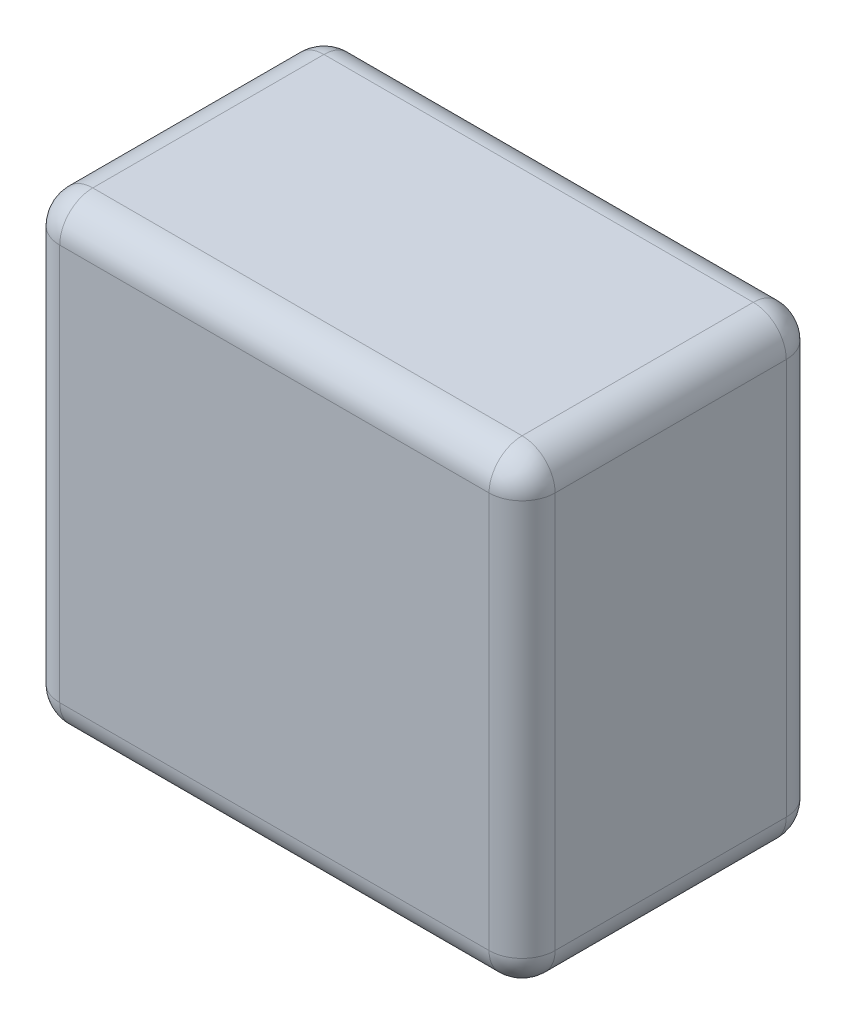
ISO-10303-21;
HEADER;
FILE_DESCRIPTION(('STEP AP214'),'2;1');
FILE_NAME('part.step','',(''),(''),'','','');
FILE_SCHEMA(('AUTOMOTIVE_DESIGN { 1 0 10303 214 1 1 1 1 }'));
ENDSEC;
DATA;
#1=APPLICATION_CONTEXT('core data for automotive mechanical design processes');
#2=APPLICATION_PROTOCOL_DEFINITION('international standard','automotive_design',2000,#1);
#3=PRODUCT_CONTEXT('',#1,'mechanical');
#4=PRODUCT('Part','Part','',(#3));
#5=PRODUCT_RELATED_PRODUCT_CATEGORY('part','',(#4));
#6=PRODUCT_DEFINITION_FORMATION('','',#4);
#7=PRODUCT_DEFINITION_CONTEXT('part definition',#1,'design');
#8=PRODUCT_DEFINITION('design','',#6,#7);
#9=PRODUCT_DEFINITION_SHAPE('','',#8);
#10=(LENGTH_UNIT() NAMED_UNIT(*) SI_UNIT(.MILLI.,.METRE.));
#11=(NAMED_UNIT(*) PLANE_ANGLE_UNIT() SI_UNIT($,.RADIAN.));
#12=(NAMED_UNIT(*) SI_UNIT($,.STERADIAN.) SOLID_ANGLE_UNIT());
#13=UNCERTAINTY_MEASURE_WITH_UNIT(LENGTH_MEASURE(1.E-05),#10,'distance_accuracy_value','');
#14=(GEOMETRIC_REPRESENTATION_CONTEXT(3) GLOBAL_UNCERTAINTY_ASSIGNED_CONTEXT((#13)) GLOBAL_UNIT_ASSIGNED_CONTEXT((#10,
#11,#12)) REPRESENTATION_CONTEXT('',''));
#15=CARTESIAN_POINT('',(0.,0.,0.));
#16=DIRECTION('',(0.,0.,1.));
#17=DIRECTION('',(1.,0.,0.));
#18=AXIS2_PLACEMENT_3D('',#15,#16,#17);
#19=CARTESIAN_POINT('',(0.,28.,0.));
#20=DIRECTION('',(1.,0.,0.));
#21=DIRECTION('',(0.,0.,-1.));
#22=AXIS2_PLACEMENT_3D('',#19,#20,#21);
#23=PLANE('',#22);
#24=DIRECTION('',(0.,0.,1.));
#25=VECTOR('',#24,1.);
#26=CARTESIAN_POINT('',(0.,26.,0.));
#27=LINE('',#26,#25);
#28=CARTESIAN_POINT('',(0.,26.,-2.));
#29=VERTEX_POINT('',#28);
#30=CARTESIAN_POINT('',(0.,26.,-16.));
#31=VERTEX_POINT('',#30);
#32=EDGE_CURVE('E138',#29,#31,#27,.F.);
#33=ORIENTED_EDGE('',*,*,#32,.T.);
#34=DIRECTION('',(0.,-1.,0.));
#35=VECTOR('',#34,1.);
#36=CARTESIAN_POINT('',(0.,28.,-16.));
#37=LINE('',#36,#35);
#38=CARTESIAN_POINT('',(0.,2.,-16.));
#39=VERTEX_POINT('',#38);
#40=EDGE_CURVE('E187',#31,#39,#37,.T.);
#41=ORIENTED_EDGE('',*,*,#40,.T.);
#42=DIRECTION('',(0.,0.,1.));
#43=VECTOR('',#42,1.);
#44=CARTESIAN_POINT('',(0.,2.,0.));
#45=LINE('',#44,#43);
#46=CARTESIAN_POINT('',(0.,2.,-2.));
#47=VERTEX_POINT('',#46);
#48=EDGE_CURVE('E184',#39,#47,#45,.T.);
#49=ORIENTED_EDGE('',*,*,#48,.T.);
#50=DIRECTION('',(0.,-1.,0.));
#51=VECTOR('',#50,1.);
#52=CARTESIAN_POINT('',(0.,28.,-2.));
#53=LINE('',#52,#51);
#54=EDGE_CURVE('E182',#47,#29,#53,.F.);
#55=ORIENTED_EDGE('',*,*,#54,.T.);
#56=EDGE_LOOP('',(#33,#41,#49,#55));
#57=FACE_BOUND('',#56,.T.);
#58=ADVANCED_FACE('F32',(#57),#23,.F.);
#59=CARTESIAN_POINT('',(0.,28.,0.));
#60=DIRECTION('',(0.,0.,-1.));
#61=DIRECTION('',(-1.,0.,0.));
#62=AXIS2_PLACEMENT_3D('',#59,#60,#61);
#63=PLANE('',#62);
#64=DIRECTION('',(1.,0.,0.));
#65=VECTOR('',#64,1.);
#66=CARTESIAN_POINT('',(0.,26.,0.));
#67=LINE('',#66,#65);
#68=CARTESIAN_POINT('',(28.,26.,0.));
#69=VERTEX_POINT('',#68);
#70=CARTESIAN_POINT('',(2.,26.,0.));
#71=VERTEX_POINT('',#70);
#72=EDGE_CURVE('E193',#69,#71,#67,.F.);
#73=ORIENTED_EDGE('',*,*,#72,.T.);
#74=DIRECTION('',(0.,-1.,0.));
#75=VECTOR('',#74,1.);
#76=CARTESIAN_POINT('',(2.,28.,0.));
#77=LINE('',#76,#75);
#78=CARTESIAN_POINT('',(2.,2.,0.));
#79=VERTEX_POINT('',#78);
#80=EDGE_CURVE('E196',#71,#79,#77,.T.);
#81=ORIENTED_EDGE('',*,*,#80,.T.);
#82=DIRECTION('',(1.,0.,0.));
#83=VECTOR('',#82,1.);
#84=CARTESIAN_POINT('',(30.,2.,0.));
#85=LINE('',#84,#83);
#86=CARTESIAN_POINT('',(28.,2.,0.));
#87=VERTEX_POINT('',#86);
#88=EDGE_CURVE('E191',#79,#87,#85,.T.);
#89=ORIENTED_EDGE('',*,*,#88,.T.);
#90=DIRECTION('',(0.,-1.,0.));
#91=VECTOR('',#90,1.);
#92=CARTESIAN_POINT('',(28.,28.,0.));
#93=LINE('',#92,#91);
#94=EDGE_CURVE('E189',#87,#69,#93,.F.);
#95=ORIENTED_EDGE('',*,*,#94,.T.);
#96=EDGE_LOOP('',(#73,#81,#89,#95));
#97=FACE_BOUND('',#96,.T.);
#98=ADVANCED_FACE('F299',(#97),#63,.F.);
#99=CARTESIAN_POINT('',(30.,28.,0.));
#100=DIRECTION('',(-1.,0.,0.));
#101=DIRECTION('',(0.,0.,1.));
#102=AXIS2_PLACEMENT_3D('',#99,#100,#101);
#103=PLANE('',#102);
#104=DIRECTION('',(0.,0.,-1.));
#105=VECTOR('',#104,1.);
#106=CARTESIAN_POINT('',(30.,2.,-18.));
#107=LINE('',#106,#105);
#108=CARTESIAN_POINT('',(30.,2.,-2.));
#109=VERTEX_POINT('',#108);
#110=CARTESIAN_POINT('',(30.,2.,-16.));
#111=VERTEX_POINT('',#110);
#112=EDGE_CURVE('E166',#109,#111,#107,.T.);
#113=ORIENTED_EDGE('',*,*,#112,.T.);
#114=DIRECTION('',(0.,-1.,0.));
#115=VECTOR('',#114,1.);
#116=CARTESIAN_POINT('',(30.,28.,-16.));
#117=LINE('',#116,#115);
#118=CARTESIAN_POINT('',(30.,26.,-16.));
#119=VERTEX_POINT('',#118);
#120=EDGE_CURVE('E171',#111,#119,#117,.F.);
#121=ORIENTED_EDGE('',*,*,#120,.T.);
#122=DIRECTION('',(0.,0.,-1.));
#123=VECTOR('',#122,1.);
#124=CARTESIAN_POINT('',(30.,26.,0.));
#125=LINE('',#124,#123);
#126=CARTESIAN_POINT('',(30.,26.,-2.));
#127=VERTEX_POINT('',#126);
#128=EDGE_CURVE('E168',#119,#127,#125,.F.);
#129=ORIENTED_EDGE('',*,*,#128,.T.);
#130=DIRECTION('',(0.,-1.,0.));
#131=VECTOR('',#130,1.);
#132=CARTESIAN_POINT('',(30.,28.,-2.));
#133=LINE('',#132,#131);
#134=EDGE_CURVE('E164',#127,#109,#133,.T.);
#135=ORIENTED_EDGE('',*,*,#134,.T.);
#136=EDGE_LOOP('',(#113,#121,#129,#135));
#137=FACE_BOUND('',#136,.T.);
#138=ADVANCED_FACE('F304',(#137),#103,.F.);
#139=CARTESIAN_POINT('',(0.,28.,-18.));
#140=DIRECTION('',(0.,0.,1.));
#141=DIRECTION('',(1.,0.,0.));
#142=AXIS2_PLACEMENT_3D('',#139,#140,#141);
#143=PLANE('',#142);
#144=DIRECTION('',(-1.,0.,0.));
#145=VECTOR('',#144,1.);
#146=CARTESIAN_POINT('',(0.,2.,-18.));
#147=LINE('',#146,#145);
#148=CARTESIAN_POINT('',(28.,2.,-18.));
#149=VERTEX_POINT('',#148);
#150=CARTESIAN_POINT('',(2.,2.,-18.));
#151=VERTEX_POINT('',#150);
#152=EDGE_CURVE('E175',#149,#151,#147,.T.);
#153=ORIENTED_EDGE('',*,*,#152,.T.);
#154=DIRECTION('',(0.,-1.,0.));
#155=VECTOR('',#154,1.);
#156=CARTESIAN_POINT('',(2.,28.,-18.));
#157=LINE('',#156,#155);
#158=CARTESIAN_POINT('',(2.,26.,-18.));
#159=VERTEX_POINT('',#158);
#160=EDGE_CURVE('E180',#151,#159,#157,.F.);
#161=ORIENTED_EDGE('',*,*,#160,.T.);
#162=DIRECTION('',(-1.,0.,0.));
#163=VECTOR('',#162,1.);
#164=CARTESIAN_POINT('',(0.,26.,-18.));
#165=LINE('',#164,#163);
#166=CARTESIAN_POINT('',(28.,26.,-18.));
#167=VERTEX_POINT('',#166);
#168=EDGE_CURVE('E177',#159,#167,#165,.F.);
#169=ORIENTED_EDGE('',*,*,#168,.T.);
#170=DIRECTION('',(0.,-1.,0.));
#171=VECTOR('',#170,1.);
#172=CARTESIAN_POINT('',(28.,28.,-18.));
#173=LINE('',#172,#171);
#174=EDGE_CURVE('E173',#167,#149,#173,.T.);
#175=ORIENTED_EDGE('',*,*,#174,.T.);
#176=EDGE_LOOP('',(#153,#161,#169,#175));
#177=FACE_BOUND('',#176,.T.);
#178=ADVANCED_FACE('F264',(#177),#143,.F.);
#179=CARTESIAN_POINT('',(0.,28.,0.));
#180=DIRECTION('',(0.,-1.,0.));
#181=DIRECTION('',(0.,0.,-1.));
#182=AXIS2_PLACEMENT_3D('',#179,#180,#181);
#183=PLANE('',#182);
#184=DIRECTION('',(1.,0.,0.));
#185=VECTOR('',#184,1.);
#186=CARTESIAN_POINT('',(0.,28.,-2.));
#187=LINE('',#186,#185);
#188=CARTESIAN_POINT('',(2.,28.,-2.));
#189=VERTEX_POINT('',#188);
#190=CARTESIAN_POINT('',(28.,28.,-2.));
#191=VERTEX_POINT('',#190);
#192=EDGE_CURVE('E124',#189,#191,#187,.T.);
#193=ORIENTED_EDGE('',*,*,#192,.T.);
#194=DIRECTION('',(0.,0.,-1.));
#195=VECTOR('',#194,1.);
#196=CARTESIAN_POINT('',(28.,28.,0.));
#197=LINE('',#196,#195);
#198=CARTESIAN_POINT('',(28.,28.,-16.));
#199=VERTEX_POINT('',#198);
#200=EDGE_CURVE('E162',#191,#199,#197,.T.);
#201=ORIENTED_EDGE('',*,*,#200,.T.);
#202=DIRECTION('',(-1.,0.,0.));
#203=VECTOR('',#202,1.);
#204=CARTESIAN_POINT('',(0.,28.,-16.));
#205=LINE('',#204,#203);
#206=CARTESIAN_POINT('',(2.,28.,-16.));
#207=VERTEX_POINT('',#206);
#208=EDGE_CURVE('E127',#199,#207,#205,.T.);
#209=ORIENTED_EDGE('',*,*,#208,.T.);
#210=DIRECTION('',(0.,0.,1.));
#211=VECTOR('',#210,1.);
#212=CARTESIAN_POINT('',(2.,28.,0.));
#213=LINE('',#212,#211);
#214=EDGE_CURVE('E119',#207,#189,#213,.T.);
#215=ORIENTED_EDGE('',*,*,#214,.T.);
#216=EDGE_LOOP('',(#193,#201,#209,#215));
#217=FACE_BOUND('',#216,.T.);
#218=ADVANCED_FACE('F121',(#217),#183,.F.);
#219=CARTESIAN_POINT('',(0.,0.,0.));
#220=DIRECTION('',(0.,-1.,0.));
#221=DIRECTION('',(0.,0.,-1.));
#222=AXIS2_PLACEMENT_3D('',#219,#220,#221);
#223=PLANE('',#222);
#224=DIRECTION('',(0.,0.,-1.));
#225=VECTOR('',#224,1.);
#226=CARTESIAN_POINT('',(28.,0.,0.));
#227=LINE('',#226,#225);
#228=CARTESIAN_POINT('',(28.,0.,-16.));
#229=VERTEX_POINT('',#228);
#230=CARTESIAN_POINT('',(28.,0.,-2.));
#231=VERTEX_POINT('',#230);
#232=EDGE_CURVE('E41',#229,#231,#227,.F.);
#233=ORIENTED_EDGE('',*,*,#232,.T.);
#234=DIRECTION('',(1.,0.,0.));
#235=VECTOR('',#234,1.);
#236=CARTESIAN_POINT('',(0.,0.,-2.));
#237=LINE('',#236,#235);
#238=CARTESIAN_POINT('',(2.,0.,-2.));
#239=VERTEX_POINT('',#238);
#240=EDGE_CURVE('E11',#231,#239,#237,.F.);
#241=ORIENTED_EDGE('',*,*,#240,.T.);
#242=DIRECTION('',(0.,0.,1.));
#243=VECTOR('',#242,1.);
#244=CARTESIAN_POINT('',(2.,0.,-18.));
#245=LINE('',#244,#243);
#246=CARTESIAN_POINT('',(2.,0.,-16.));
#247=VERTEX_POINT('',#246);
#248=EDGE_CURVE('E198',#239,#247,#245,.F.);
#249=ORIENTED_EDGE('',*,*,#248,.T.);
#250=DIRECTION('',(-1.,0.,0.));
#251=VECTOR('',#250,1.);
#252=CARTESIAN_POINT('',(30.,0.,-16.));
#253=LINE('',#252,#251);
#254=EDGE_CURVE('E52',#247,#229,#253,.F.);
#255=ORIENTED_EDGE('',*,*,#254,.T.);
#256=EDGE_LOOP('',(#233,#241,#249,#255));
#257=FACE_BOUND('',#256,.T.);
#258=ADVANCED_FACE('F289',(#257),#223,.T.);
#259=CARTESIAN_POINT('',(2.,2.,0.));
#260=DIRECTION('',(0.,0.,-1.));
#261=DIRECTION('',(-1.,0.,0.));
#262=AXIS2_PLACEMENT_3D('',#259,#260,#261);
#263=CYLINDRICAL_SURFACE('',#262,2.);
#264=CARTESIAN_POINT('',(2.,2.,-2.));
#265=DIRECTION('',(0.,0.,1.));
#266=DIRECTION('',(1.,0.,0.));
#267=AXIS2_PLACEMENT_3D('',#264,#265,#266);
#268=CIRCLE('',#267,2.);
#269=EDGE_CURVE('E36',#47,#239,#268,.T.);
#270=ORIENTED_EDGE('',*,*,#269,.F.);
#271=ORIENTED_EDGE('',*,*,#48,.F.);
#272=CARTESIAN_POINT('',(2.,2.,-16.));
#273=DIRECTION('',(0.,0.,-1.));
#274=DIRECTION('',(-1.,0.,0.));
#275=AXIS2_PLACEMENT_3D('',#272,#273,#274);
#276=CIRCLE('',#275,2.);
#277=EDGE_CURVE('E159',#247,#39,#276,.T.);
#278=ORIENTED_EDGE('',*,*,#277,.F.);
#279=ORIENTED_EDGE('',*,*,#248,.F.);
#280=EDGE_LOOP('',(#270,#271,#278,#279));
#281=FACE_BOUND('',#280,.T.);
#282=ADVANCED_FACE('F34',(#281),#263,.T.);
#283=CARTESIAN_POINT('',(2.,2.,-2.));
#284=DIRECTION('',(0.,0.,1.));
#285=DIRECTION('',(1.,0.,0.));
#286=AXIS2_PLACEMENT_3D('',#283,#284,#285);
#287=SPHERICAL_SURFACE('',#286,2.);
#288=CARTESIAN_POINT('',(2.,2.,-2.));
#289=DIRECTION('',(0.,-1.,0.));
#290=DIRECTION('',(0.,0.,-1.));
#291=AXIS2_PLACEMENT_3D('',#288,#289,#290);
#292=CIRCLE('',#291,2.);
#293=EDGE_CURVE('E244',#47,#79,#292,.F.);
#294=ORIENTED_EDGE('',*,*,#293,.F.);
#295=ORIENTED_EDGE('',*,*,#269,.T.);
#296=CARTESIAN_POINT('',(2.,2.,-2.));
#297=DIRECTION('',(-1.,0.,0.));
#298=DIRECTION('',(0.,0.,1.));
#299=AXIS2_PLACEMENT_3D('',#296,#297,#298);
#300=CIRCLE('',#299,2.);
#301=EDGE_CURVE('E247',#79,#239,#300,.F.);
#302=ORIENTED_EDGE('',*,*,#301,.F.);
#303=EDGE_LOOP('',(#294,#295,#302));
#304=FACE_BOUND('',#303,.T.);
#305=ADVANCED_FACE('F294',(#304),#287,.T.);
#306=CARTESIAN_POINT('',(2.,2.,-16.));
#307=DIRECTION('',(0.,0.,1.));
#308=DIRECTION('',(1.,0.,0.));
#309=AXIS2_PLACEMENT_3D('',#306,#307,#308);
#310=SPHERICAL_SURFACE('',#309,2.);
#311=CARTESIAN_POINT('',(2.,2.,-16.));
#312=DIRECTION('',(-1.,0.,0.));
#313=DIRECTION('',(0.,0.,1.));
#314=AXIS2_PLACEMENT_3D('',#311,#312,#313);
#315=CIRCLE('',#314,2.);
#316=EDGE_CURVE('E238',#247,#151,#315,.F.);
#317=ORIENTED_EDGE('',*,*,#316,.F.);
#318=ORIENTED_EDGE('',*,*,#277,.T.);
#319=CARTESIAN_POINT('',(2.,2.,-16.));
#320=DIRECTION('',(0.,-1.,0.));
#321=DIRECTION('',(0.,0.,-1.));
#322=AXIS2_PLACEMENT_3D('',#319,#320,#321);
#323=CIRCLE('',#322,2.);
#324=EDGE_CURVE('E241',#151,#39,#323,.F.);
#325=ORIENTED_EDGE('',*,*,#324,.F.);
#326=EDGE_LOOP('',(#317,#318,#325));
#327=FACE_BOUND('',#326,.T.);
#328=ADVANCED_FACE('F253',(#327),#310,.T.);
#329=CARTESIAN_POINT('',(0.,2.,-2.));
#330=DIRECTION('',(-1.,0.,0.));
#331=DIRECTION('',(0.,0.,1.));
#332=AXIS2_PLACEMENT_3D('',#329,#330,#331);
#333=CYLINDRICAL_SURFACE('',#332,2.);
#334=ORIENTED_EDGE('',*,*,#301,.T.);
#335=ORIENTED_EDGE('',*,*,#240,.F.);
#336=CARTESIAN_POINT('',(28.,2.,-2.));
#337=DIRECTION('',(1.,0.,0.));
#338=DIRECTION('',(0.,0.,-1.));
#339=AXIS2_PLACEMENT_3D('',#336,#337,#338);
#340=CIRCLE('',#339,2.);
#341=EDGE_CURVE('E232',#87,#231,#340,.T.);
#342=ORIENTED_EDGE('',*,*,#341,.F.);
#343=ORIENTED_EDGE('',*,*,#88,.F.);
#344=EDGE_LOOP('',(#334,#335,#342,#343));
#345=FACE_BOUND('',#344,.T.);
#346=ADVANCED_FACE('F287',(#345),#333,.T.);
#347=CARTESIAN_POINT('',(2.,28.,-2.));
#348=DIRECTION('',(0.,-1.,0.));
#349=DIRECTION('',(0.,0.,-1.));
#350=AXIS2_PLACEMENT_3D('',#347,#348,#349);
#351=CYLINDRICAL_SURFACE('',#350,2.);
#352=ORIENTED_EDGE('',*,*,#293,.T.);
#353=ORIENTED_EDGE('',*,*,#80,.F.);
#354=CARTESIAN_POINT('',(2.,26.,-2.));
#355=DIRECTION('',(0.,1.,0.));
#356=DIRECTION('',(0.,0.,1.));
#357=AXIS2_PLACEMENT_3D('',#354,#355,#356);
#358=CIRCLE('',#357,2.);
#359=EDGE_CURVE('E142',#29,#71,#358,.T.);
#360=ORIENTED_EDGE('',*,*,#359,.F.);
#361=ORIENTED_EDGE('',*,*,#54,.F.);
#362=EDGE_LOOP('',(#352,#353,#360,#361));
#363=FACE_BOUND('',#362,.T.);
#364=ADVANCED_FACE('F296',(#363),#351,.T.);
#365=CARTESIAN_POINT('',(2.,26.,0.));
#366=DIRECTION('',(0.,0.,1.));
#367=DIRECTION('',(1.,0.,0.));
#368=AXIS2_PLACEMENT_3D('',#365,#366,#367);
#369=CYLINDRICAL_SURFACE('',#368,2.);
#370=CARTESIAN_POINT('',(2.,26.,-16.));
#371=DIRECTION('',(0.,0.,-1.));
#372=DIRECTION('',(-1.,0.,0.));
#373=AXIS2_PLACEMENT_3D('',#370,#371,#372);
#374=CIRCLE('',#373,2.);
#375=EDGE_CURVE('E143',#31,#207,#374,.T.);
#376=ORIENTED_EDGE('',*,*,#375,.F.);
#377=ORIENTED_EDGE('',*,*,#32,.F.);
#378=CARTESIAN_POINT('',(2.,26.,-2.));
#379=DIRECTION('',(0.,0.,1.));
#380=DIRECTION('',(1.,0.,0.));
#381=AXIS2_PLACEMENT_3D('',#378,#379,#380);
#382=CIRCLE('',#381,2.);
#383=EDGE_CURVE('E134',#189,#29,#382,.T.);
#384=ORIENTED_EDGE('',*,*,#383,.F.);
#385=ORIENTED_EDGE('',*,*,#214,.F.);
#386=EDGE_LOOP('',(#376,#377,#384,#385));
#387=FACE_BOUND('',#386,.T.);
#388=ADVANCED_FACE('F136',(#387),#369,.T.);
#389=CARTESIAN_POINT('',(2.,28.,-16.));
#390=DIRECTION('',(0.,-1.,0.));
#391=DIRECTION('',(0.,0.,-1.));
#392=AXIS2_PLACEMENT_3D('',#389,#390,#391);
#393=CYLINDRICAL_SURFACE('',#392,2.);
#394=ORIENTED_EDGE('',*,*,#324,.T.);
#395=ORIENTED_EDGE('',*,*,#40,.F.);
#396=CARTESIAN_POINT('',(2.,26.,-16.));
#397=DIRECTION('',(0.,1.,0.));
#398=DIRECTION('',(0.,0.,1.));
#399=AXIS2_PLACEMENT_3D('',#396,#397,#398);
#400=CIRCLE('',#399,2.);
#401=EDGE_CURVE('E228',#159,#31,#400,.T.);
#402=ORIENTED_EDGE('',*,*,#401,.F.);
#403=ORIENTED_EDGE('',*,*,#160,.F.);
#404=EDGE_LOOP('',(#394,#395,#402,#403));
#405=FACE_BOUND('',#404,.T.);
#406=ADVANCED_FACE('F260',(#405),#393,.T.);
#407=CARTESIAN_POINT('',(0.,2.,-16.));
#408=DIRECTION('',(1.,0.,0.));
#409=DIRECTION('',(0.,0.,-1.));
#410=AXIS2_PLACEMENT_3D('',#407,#408,#409);
#411=CYLINDRICAL_SURFACE('',#410,2.);
#412=ORIENTED_EDGE('',*,*,#316,.T.);
#413=ORIENTED_EDGE('',*,*,#152,.F.);
#414=CARTESIAN_POINT('',(28.,2.,-16.));
#415=DIRECTION('',(1.,0.,0.));
#416=DIRECTION('',(0.,0.,-1.));
#417=AXIS2_PLACEMENT_3D('',#414,#415,#416);
#418=CIRCLE('',#417,2.);
#419=EDGE_CURVE('E225',#229,#149,#418,.T.);
#420=ORIENTED_EDGE('',*,*,#419,.F.);
#421=ORIENTED_EDGE('',*,*,#254,.F.);
#422=EDGE_LOOP('',(#412,#413,#420,#421));
#423=FACE_BOUND('',#422,.T.);
#424=ADVANCED_FACE('F270',(#423),#411,.T.);
#425=CARTESIAN_POINT('',(28.,2.,0.));
#426=DIRECTION('',(0.,0.,1.));
#427=DIRECTION('',(1.,0.,0.));
#428=AXIS2_PLACEMENT_3D('',#425,#426,#427);
#429=CYLINDRICAL_SURFACE('',#428,2.);
#430=CARTESIAN_POINT('',(28.,2.,-2.));
#431=DIRECTION('',(0.,0.,1.));
#432=DIRECTION('',(1.,0.,0.));
#433=AXIS2_PLACEMENT_3D('',#430,#431,#432);
#434=CIRCLE('',#433,2.);
#435=EDGE_CURVE('E235',#231,#109,#434,.T.);
#436=ORIENTED_EDGE('',*,*,#435,.F.);
#437=ORIENTED_EDGE('',*,*,#232,.F.);
#438=CARTESIAN_POINT('',(28.,2.,-16.));
#439=DIRECTION('',(0.,0.,-1.));
#440=DIRECTION('',(-1.,0.,0.));
#441=AXIS2_PLACEMENT_3D('',#438,#439,#440);
#442=CIRCLE('',#441,2.);
#443=EDGE_CURVE('E222',#111,#229,#442,.T.);
#444=ORIENTED_EDGE('',*,*,#443,.F.);
#445=ORIENTED_EDGE('',*,*,#112,.F.);
#446=EDGE_LOOP('',(#436,#437,#444,#445));
#447=FACE_BOUND('',#446,.T.);
#448=ADVANCED_FACE('F279',(#447),#429,.T.);
#449=CARTESIAN_POINT('',(28.,2.,-2.));
#450=DIRECTION('',(0.,0.,1.));
#451=DIRECTION('',(1.,0.,0.));
#452=AXIS2_PLACEMENT_3D('',#449,#450,#451);
#453=SPHERICAL_SURFACE('',#452,2.);
#454=ORIENTED_EDGE('',*,*,#341,.T.);
#455=ORIENTED_EDGE('',*,*,#435,.T.);
#456=CARTESIAN_POINT('',(28.,2.,-2.));
#457=DIRECTION('',(0.,-1.,0.));
#458=DIRECTION('',(0.,0.,-1.));
#459=AXIS2_PLACEMENT_3D('',#456,#457,#458);
#460=CIRCLE('',#459,2.);
#461=EDGE_CURVE('E150',#87,#109,#460,.F.);
#462=ORIENTED_EDGE('',*,*,#461,.F.);
#463=EDGE_LOOP('',(#454,#455,#462));
#464=FACE_BOUND('',#463,.T.);
#465=ADVANCED_FACE('F283',(#464),#453,.T.);
#466=CARTESIAN_POINT('',(2.,26.,-2.));
#467=DIRECTION('',(0.,0.,1.));
#468=DIRECTION('',(1.,0.,0.));
#469=AXIS2_PLACEMENT_3D('',#466,#467,#468);
#470=SPHERICAL_SURFACE('',#469,2.);
#471=ORIENTED_EDGE('',*,*,#383,.T.);
#472=ORIENTED_EDGE('',*,*,#359,.T.);
#473=CARTESIAN_POINT('',(2.,26.,-2.));
#474=DIRECTION('',(-1.,0.,0.));
#475=DIRECTION('',(0.,0.,1.));
#476=AXIS2_PLACEMENT_3D('',#473,#474,#475);
#477=CIRCLE('',#476,2.);
#478=EDGE_CURVE('E145',#189,#71,#477,.F.);
#479=ORIENTED_EDGE('',*,*,#478,.F.);
#480=EDGE_LOOP('',(#471,#472,#479));
#481=FACE_BOUND('',#480,.T.);
#482=ADVANCED_FACE('F146',(#481),#470,.T.);
#483=CARTESIAN_POINT('',(2.,26.,-16.));
#484=DIRECTION('',(0.,0.,1.));
#485=DIRECTION('',(1.,0.,0.));
#486=AXIS2_PLACEMENT_3D('',#483,#484,#485);
#487=SPHERICAL_SURFACE('',#486,2.);
#488=ORIENTED_EDGE('',*,*,#401,.T.);
#489=ORIENTED_EDGE('',*,*,#375,.T.);
#490=CARTESIAN_POINT('',(2.,26.,-16.));
#491=DIRECTION('',(-1.,0.,0.));
#492=DIRECTION('',(0.,0.,1.));
#493=AXIS2_PLACEMENT_3D('',#490,#491,#492);
#494=CIRCLE('',#493,2.);
#495=EDGE_CURVE('E151',#159,#207,#494,.F.);
#496=ORIENTED_EDGE('',*,*,#495,.F.);
#497=EDGE_LOOP('',(#488,#489,#496));
#498=FACE_BOUND('',#497,.T.);
#499=ADVANCED_FACE('F337',(#498),#487,.T.);
#500=CARTESIAN_POINT('',(28.,2.,-16.));
#501=DIRECTION('',(0.,0.,1.));
#502=DIRECTION('',(1.,0.,0.));
#503=AXIS2_PLACEMENT_3D('',#500,#501,#502);
#504=SPHERICAL_SURFACE('',#503,2.);
#505=ORIENTED_EDGE('',*,*,#443,.T.);
#506=ORIENTED_EDGE('',*,*,#419,.T.);
#507=CARTESIAN_POINT('',(28.,2.,-16.));
#508=DIRECTION('',(0.,-1.,0.));
#509=DIRECTION('',(0.,0.,-1.));
#510=AXIS2_PLACEMENT_3D('',#507,#508,#509);
#511=CIRCLE('',#510,2.);
#512=EDGE_CURVE('E215',#111,#149,#511,.F.);
#513=ORIENTED_EDGE('',*,*,#512,.F.);
#514=EDGE_LOOP('',(#505,#506,#513));
#515=FACE_BOUND('',#514,.T.);
#516=ADVANCED_FACE('F274',(#515),#504,.T.);
#517=CARTESIAN_POINT('',(28.,28.,-2.));
#518=DIRECTION('',(0.,-1.,0.));
#519=DIRECTION('',(0.,0.,-1.));
#520=AXIS2_PLACEMENT_3D('',#517,#518,#519);
#521=CYLINDRICAL_SURFACE('',#520,2.);
#522=ORIENTED_EDGE('',*,*,#461,.T.);
#523=ORIENTED_EDGE('',*,*,#134,.F.);
#524=CARTESIAN_POINT('',(28.,26.,-2.));
#525=DIRECTION('',(0.,1.,0.));
#526=DIRECTION('',(0.,0.,1.));
#527=AXIS2_PLACEMENT_3D('',#524,#525,#526);
#528=CIRCLE('',#527,2.);
#529=EDGE_CURVE('E212',#69,#127,#528,.T.);
#530=ORIENTED_EDGE('',*,*,#529,.F.);
#531=ORIENTED_EDGE('',*,*,#94,.F.);
#532=EDGE_LOOP('',(#522,#523,#530,#531));
#533=FACE_BOUND('',#532,.T.);
#534=ADVANCED_FACE('F331',(#533),#521,.T.);
#535=CARTESIAN_POINT('',(0.,26.,-2.));
#536=DIRECTION('',(1.,0.,0.));
#537=DIRECTION('',(0.,0.,-1.));
#538=AXIS2_PLACEMENT_3D('',#535,#536,#537);
#539=CYLINDRICAL_SURFACE('',#538,2.);
#540=ORIENTED_EDGE('',*,*,#478,.T.);
#541=ORIENTED_EDGE('',*,*,#72,.F.);
#542=CARTESIAN_POINT('',(28.,26.,-2.));
#543=DIRECTION('',(1.,0.,0.));
#544=DIRECTION('',(0.,0.,-1.));
#545=AXIS2_PLACEMENT_3D('',#542,#543,#544);
#546=CIRCLE('',#545,2.);
#547=EDGE_CURVE('E155',#191,#69,#546,.T.);
#548=ORIENTED_EDGE('',*,*,#547,.F.);
#549=ORIENTED_EDGE('',*,*,#192,.F.);
#550=EDGE_LOOP('',(#540,#541,#548,#549));
#551=FACE_BOUND('',#550,.T.);
#552=ADVANCED_FACE('F153',(#551),#539,.T.);
#553=CARTESIAN_POINT('',(0.,26.,-16.));
#554=DIRECTION('',(-1.,0.,0.));
#555=DIRECTION('',(0.,0.,1.));
#556=AXIS2_PLACEMENT_3D('',#553,#554,#555);
#557=CYLINDRICAL_SURFACE('',#556,2.);
#558=ORIENTED_EDGE('',*,*,#495,.T.);
#559=ORIENTED_EDGE('',*,*,#208,.F.);
#560=CARTESIAN_POINT('',(28.,26.,-16.));
#561=DIRECTION('',(1.,0.,0.));
#562=DIRECTION('',(0.,0.,-1.));
#563=AXIS2_PLACEMENT_3D('',#560,#561,#562);
#564=CIRCLE('',#563,2.);
#565=EDGE_CURVE('E208',#167,#199,#564,.T.);
#566=ORIENTED_EDGE('',*,*,#565,.F.);
#567=ORIENTED_EDGE('',*,*,#168,.F.);
#568=EDGE_LOOP('',(#558,#559,#566,#567));
#569=FACE_BOUND('',#568,.T.);
#570=ADVANCED_FACE('F324',(#569),#557,.T.);
#571=CARTESIAN_POINT('',(28.,28.,-16.));
#572=DIRECTION('',(0.,-1.,0.));
#573=DIRECTION('',(0.,0.,-1.));
#574=AXIS2_PLACEMENT_3D('',#571,#572,#573);
#575=CYLINDRICAL_SURFACE('',#574,2.);
#576=ORIENTED_EDGE('',*,*,#512,.T.);
#577=ORIENTED_EDGE('',*,*,#174,.F.);
#578=CARTESIAN_POINT('',(28.,26.,-16.));
#579=DIRECTION('',(0.,1.,0.));
#580=DIRECTION('',(0.,0.,1.));
#581=AXIS2_PLACEMENT_3D('',#578,#579,#580);
#582=CIRCLE('',#581,2.);
#583=EDGE_CURVE('E206',#119,#167,#582,.T.);
#584=ORIENTED_EDGE('',*,*,#583,.F.);
#585=ORIENTED_EDGE('',*,*,#120,.F.);
#586=EDGE_LOOP('',(#576,#577,#584,#585));
#587=FACE_BOUND('',#586,.T.);
#588=ADVANCED_FACE('F320',(#587),#575,.T.);
#589=CARTESIAN_POINT('',(28.,26.,-2.));
#590=DIRECTION('',(0.,0.,1.));
#591=DIRECTION('',(1.,0.,0.));
#592=AXIS2_PLACEMENT_3D('',#589,#590,#591);
#593=SPHERICAL_SURFACE('',#592,2.);
#594=ORIENTED_EDGE('',*,*,#547,.T.);
#595=ORIENTED_EDGE('',*,*,#529,.T.);
#596=CARTESIAN_POINT('',(28.,26.,-2.));
#597=DIRECTION('',(0.,0.,1.));
#598=DIRECTION('',(1.,0.,0.));
#599=AXIS2_PLACEMENT_3D('',#596,#597,#598);
#600=CIRCLE('',#599,2.);
#601=EDGE_CURVE('E204',#191,#127,#600,.F.);
#602=ORIENTED_EDGE('',*,*,#601,.F.);
#603=EDGE_LOOP('',(#594,#595,#602));
#604=FACE_BOUND('',#603,.T.);
#605=ADVANCED_FACE('F316',(#604),#593,.T.);
#606=CARTESIAN_POINT('',(28.,26.,-16.));
#607=DIRECTION('',(0.,0.,1.));
#608=DIRECTION('',(1.,0.,0.));
#609=AXIS2_PLACEMENT_3D('',#606,#607,#608);
#610=SPHERICAL_SURFACE('',#609,2.);
#611=ORIENTED_EDGE('',*,*,#583,.T.);
#612=ORIENTED_EDGE('',*,*,#565,.T.);
#613=CARTESIAN_POINT('',(28.,26.,-16.));
#614=DIRECTION('',(0.,0.,-1.));
#615=DIRECTION('',(-1.,0.,0.));
#616=AXIS2_PLACEMENT_3D('',#613,#614,#615);
#617=CIRCLE('',#616,2.);
#618=EDGE_CURVE('E202',#119,#199,#617,.F.);
#619=ORIENTED_EDGE('',*,*,#618,.F.);
#620=EDGE_LOOP('',(#611,#612,#619));
#621=FACE_BOUND('',#620,.T.);
#622=ADVANCED_FACE('F312',(#621),#610,.T.);
#623=CARTESIAN_POINT('',(28.,26.,0.));
#624=DIRECTION('',(0.,0.,-1.));
#625=DIRECTION('',(-1.,0.,0.));
#626=AXIS2_PLACEMENT_3D('',#623,#624,#625);
#627=CYLINDRICAL_SURFACE('',#626,2.);
#628=ORIENTED_EDGE('',*,*,#601,.T.);
#629=ORIENTED_EDGE('',*,*,#128,.F.);
#630=ORIENTED_EDGE('',*,*,#618,.T.);
#631=ORIENTED_EDGE('',*,*,#200,.F.);
#632=EDGE_LOOP('',(#628,#629,#630,#631));
#633=FACE_BOUND('',#632,.T.);
#634=ADVANCED_FACE('F309',(#633),#627,.T.);
#635=CLOSED_SHELL('',(#58,#98,#138,#178,#218,#258,#282,#305,#328,#346,#364,#388,#406,#424,#448,
#465,#482,#499,#516,#534,#552,#570,#588,#605,#622,#634));
#636=MANIFOLD_SOLID_BREP('B2',#635);
#637=ADVANCED_BREP_SHAPE_REPRESENTATION('',(#18,#636),#14);
#638=SHAPE_DEFINITION_REPRESENTATION(#9,#637);
ENDSEC;
END-ISO-10303-21;
